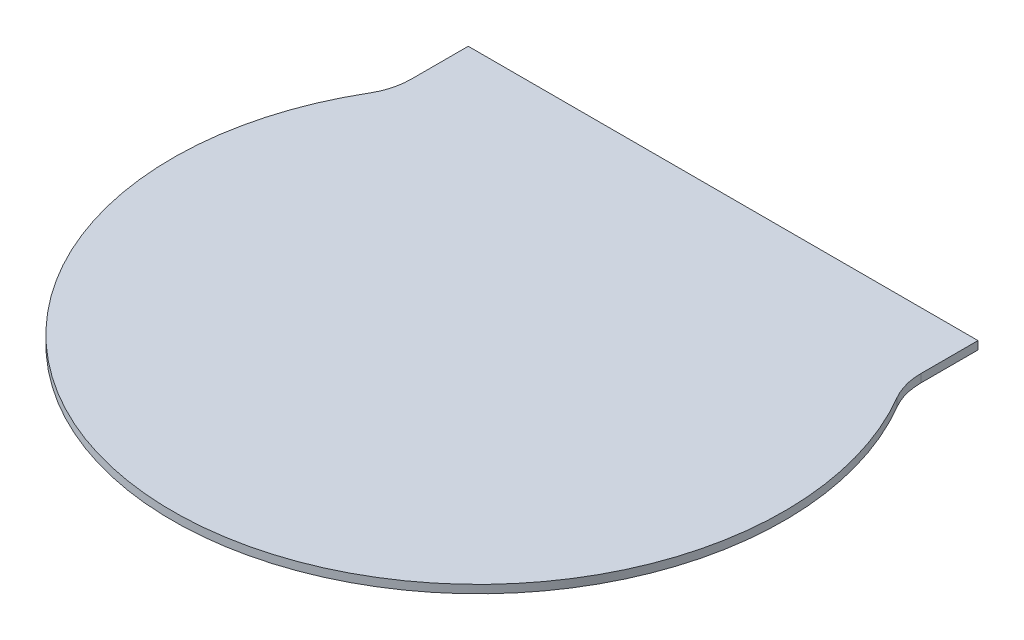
from build123d import *

# Parameters (mm, degrees)
EXTRUDE1_DEPTH = 0.1016


with BuildPart() as part:
    # Sketch1 → Extrude1 (new body)
    with BuildSketch(Plane(origin=(0, 0, 0), x_dir=(1, 0, 0), z_dir=(0, 1, 0))):
        with BuildLine():
            ThreePointArc((3.175, 2.338317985), (3.203408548, 2.125306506), (3.286648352, 1.927185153))
            ThreePointArc((3.286648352, 1.927185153), (0, -3.81), (-3.286648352, 1.927185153))
            ThreePointArc((-3.286648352, 1.927185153), (-3.203408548, 2.125306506), (-3.175, 2.338317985))
            Line((-3.175, 2.338317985), (-3.175, 3.048))
            Line((-3.175, 3.048), (3.175, 3.048))
            Line((3.175, 3.048), (3.175, 2.338317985))
        make_face()
    extrude(amount=EXTRUDE1_DEPTH)


solid = part.part
